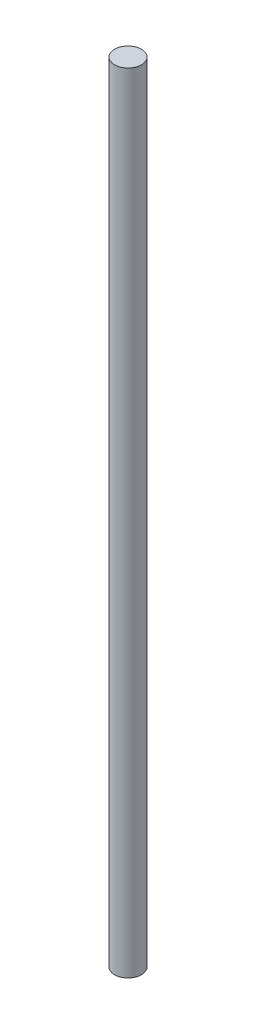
from build123d import *

# Parameters (mm, degrees)
ESQUISSE1_R      = 3.25
EXTRUSION1_DEPTH = 190


with BuildPart() as part:
    # Esquisse1 → Extrusion1 (new body)
    with BuildSketch(Plane(origin=(0, 0, 0), x_dir=(1, 0, 0), z_dir=(0, 1, 0))):
        with Locations(Location((0, 0, 0), (0, 0, 270))):
            Circle(ESQUISSE1_R)
    extrude(amount=EXTRUSION1_DEPTH)


solid = part.part
